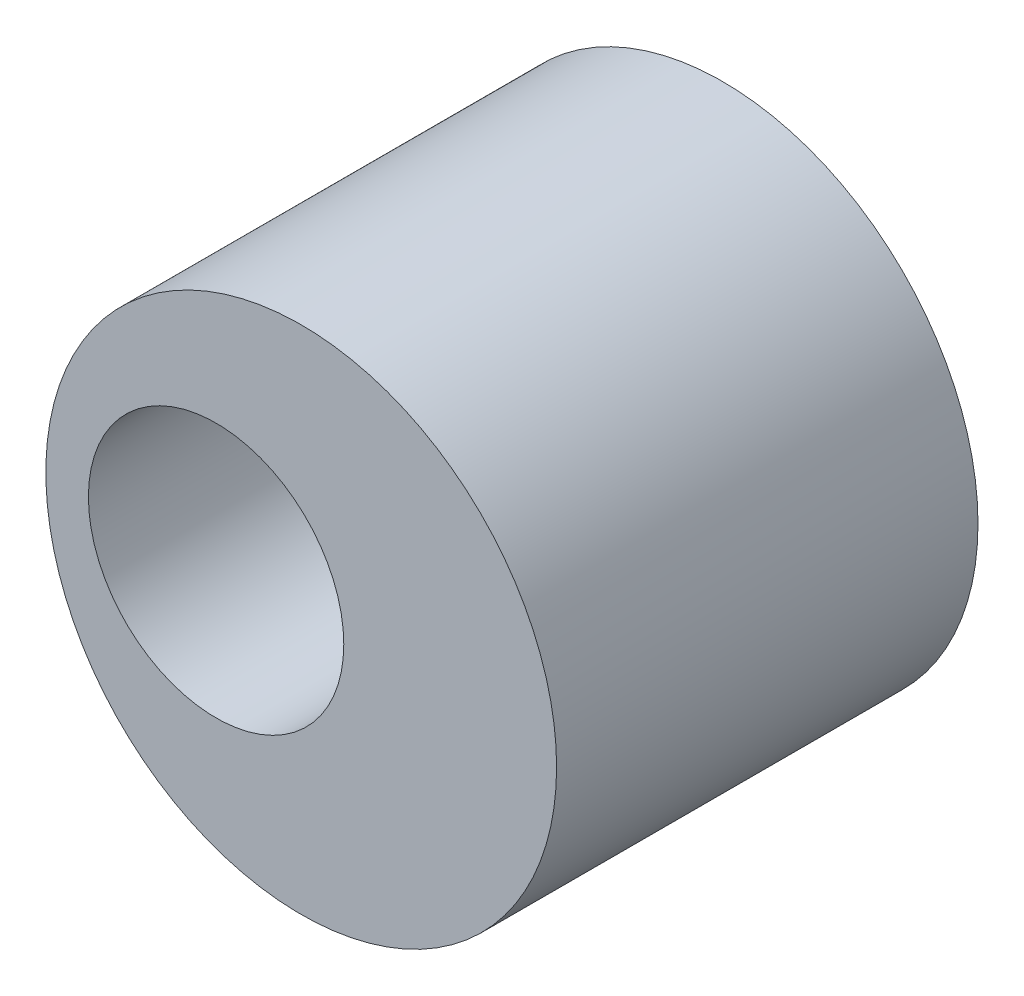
ISO-10303-21;
HEADER;
FILE_DESCRIPTION(('STEP AP214'),'2;1');
FILE_NAME('part.step','',(''),(''),'','','');
FILE_SCHEMA(('AUTOMOTIVE_DESIGN { 1 0 10303 214 1 1 1 1 }'));
ENDSEC;
DATA;
#1=APPLICATION_CONTEXT('core data for automotive mechanical design processes');
#2=APPLICATION_PROTOCOL_DEFINITION('international standard','automotive_design',2000,#1);
#3=PRODUCT_CONTEXT('',#1,'mechanical');
#4=PRODUCT('Part','Part','',(#3));
#5=PRODUCT_RELATED_PRODUCT_CATEGORY('part','',(#4));
#6=PRODUCT_DEFINITION_FORMATION('','',#4);
#7=PRODUCT_DEFINITION_CONTEXT('part definition',#1,'design');
#8=PRODUCT_DEFINITION('design','',#6,#7);
#9=PRODUCT_DEFINITION_SHAPE('','',#8);
#10=(LENGTH_UNIT() NAMED_UNIT(*) SI_UNIT(.MILLI.,.METRE.));
#11=(NAMED_UNIT(*) PLANE_ANGLE_UNIT() SI_UNIT($,.RADIAN.));
#12=(NAMED_UNIT(*) SI_UNIT($,.STERADIAN.) SOLID_ANGLE_UNIT());
#13=UNCERTAINTY_MEASURE_WITH_UNIT(LENGTH_MEASURE(1.E-05),#10,'distance_accuracy_value','');
#14=(GEOMETRIC_REPRESENTATION_CONTEXT(3) GLOBAL_UNCERTAINTY_ASSIGNED_CONTEXT((#13)) GLOBAL_UNIT_ASSIGNED_CONTEXT((#10,
#11,#12)) REPRESENTATION_CONTEXT('',''));
#15=CARTESIAN_POINT('',(0.,0.,0.));
#16=DIRECTION('',(0.,0.,1.));
#17=DIRECTION('',(1.,0.,0.));
#18=AXIS2_PLACEMENT_3D('',#15,#16,#17);
#19=CARTESIAN_POINT('',(0.,0.,9.9));
#20=DIRECTION('',(0.,0.,1.));
#21=DIRECTION('',(1.,0.,0.));
#22=AXIS2_PLACEMENT_3D('',#19,#20,#21);
#23=PLANE('',#22);
#24=CARTESIAN_POINT('',(0.,0.,9.9));
#25=DIRECTION('',(0.,0.,1.));
#26=DIRECTION('',(1.,0.,0.));
#27=AXIS2_PLACEMENT_3D('',#24,#25,#26);
#28=CIRCLE('',#27,6.);
#29=CARTESIAN_POINT('',(6.,0.,9.9));
#30=VERTEX_POINT('',#29);
#31=EDGE_CURVE('E8',#30,#30,#28,.T.);
#32=ORIENTED_EDGE('',*,*,#31,.T.);
#33=EDGE_LOOP('',(#32));
#34=FACE_BOUND('',#33,.T.);
#35=CARTESIAN_POINT('',(-2.,0.,9.9));
#36=DIRECTION('',(0.,0.,1.));
#37=DIRECTION('',(1.,0.,0.));
#38=AXIS2_PLACEMENT_3D('',#35,#36,#37);
#39=CIRCLE('',#38,3.);
#40=CARTESIAN_POINT('',(1.,0.,9.9));
#41=VERTEX_POINT('',#40);
#42=EDGE_CURVE('E23',#41,#41,#39,.T.);
#43=ORIENTED_EDGE('',*,*,#42,.F.);
#44=EDGE_LOOP('',(#43));
#45=FACE_BOUND('',#44,.T.);
#46=ADVANCED_FACE('F12',(#34,#45),#23,.T.);
#47=CARTESIAN_POINT('',(0.,0.,0.));
#48=DIRECTION('',(0.,0.,1.));
#49=DIRECTION('',(1.,0.,0.));
#50=AXIS2_PLACEMENT_3D('',#47,#48,#49);
#51=PLANE('',#50);
#52=CARTESIAN_POINT('',(0.,0.,0.));
#53=DIRECTION('',(0.,0.,1.));
#54=DIRECTION('',(1.,0.,0.));
#55=AXIS2_PLACEMENT_3D('',#52,#53,#54);
#56=CIRCLE('',#55,6.);
#57=CARTESIAN_POINT('',(6.,0.,0.));
#58=VERTEX_POINT('',#57);
#59=EDGE_CURVE('E19',#58,#58,#56,.T.);
#60=ORIENTED_EDGE('',*,*,#59,.F.);
#61=EDGE_LOOP('',(#60));
#62=FACE_BOUND('',#61,.T.);
#63=CARTESIAN_POINT('',(-2.,0.,0.));
#64=DIRECTION('',(0.,0.,1.));
#65=DIRECTION('',(1.,0.,0.));
#66=AXIS2_PLACEMENT_3D('',#63,#64,#65);
#67=CIRCLE('',#66,3.);
#68=CARTESIAN_POINT('',(1.,0.,0.));
#69=VERTEX_POINT('',#68);
#70=EDGE_CURVE('E27',#69,#69,#67,.T.);
#71=ORIENTED_EDGE('',*,*,#70,.T.);
#72=EDGE_LOOP('',(#71));
#73=FACE_BOUND('',#72,.T.);
#74=ADVANCED_FACE('F33',(#62,#73),#51,.F.);
#75=CARTESIAN_POINT('',(0.,0.,9.9));
#76=DIRECTION('',(0.,0.,-1.));
#77=DIRECTION('',(-1.,0.,0.));
#78=AXIS2_PLACEMENT_3D('',#75,#76,#77);
#79=CYLINDRICAL_SURFACE('',#78,6.);
#80=ORIENTED_EDGE('',*,*,#31,.F.);
#81=EDGE_LOOP('',(#80));
#82=FACE_BOUND('',#81,.T.);
#83=ORIENTED_EDGE('',*,*,#59,.T.);
#84=EDGE_LOOP('',(#83));
#85=FACE_BOUND('',#84,.T.);
#86=ADVANCED_FACE('F14',(#82,#85),#79,.T.);
#87=CARTESIAN_POINT('',(-2.,0.,9.9));
#88=DIRECTION('',(0.,0.,-1.));
#89=DIRECTION('',(-1.,0.,0.));
#90=AXIS2_PLACEMENT_3D('',#87,#88,#89);
#91=CYLINDRICAL_SURFACE('',#90,3.);
#92=ORIENTED_EDGE('',*,*,#42,.T.);
#93=EDGE_LOOP('',(#92));
#94=FACE_BOUND('',#93,.T.);
#95=ORIENTED_EDGE('',*,*,#70,.F.);
#96=EDGE_LOOP('',(#95));
#97=FACE_BOUND('',#96,.T.);
#98=ADVANCED_FACE('F35',(#94,#97),#91,.F.);
#99=CLOSED_SHELL('',(#46,#74,#86,#98));
#100=MANIFOLD_SOLID_BREP('B1',#99);
#101=ADVANCED_BREP_SHAPE_REPRESENTATION('',(#18,#100),#14);
#102=SHAPE_DEFINITION_REPRESENTATION(#9,#101);
ENDSEC;
END-ISO-10303-21;
